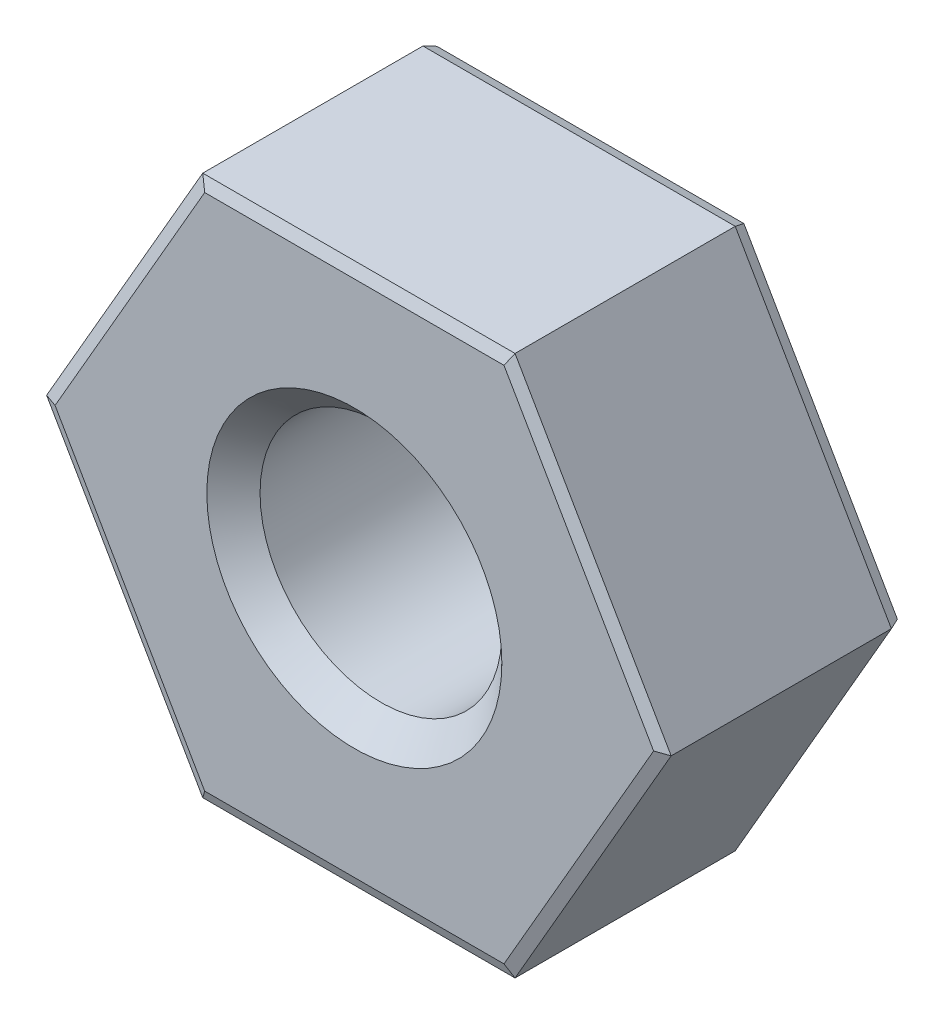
ISO-10303-21;
HEADER;
FILE_DESCRIPTION(('STEP AP214'),'2;1');
FILE_NAME('part.step','',(''),(''),'','','');
FILE_SCHEMA(('AUTOMOTIVE_DESIGN { 1 0 10303 214 1 1 1 1 }'));
ENDSEC;
DATA;
#1=APPLICATION_CONTEXT('core data for automotive mechanical design processes');
#2=APPLICATION_PROTOCOL_DEFINITION('international standard','automotive_design',2000,#1);
#3=PRODUCT_CONTEXT('',#1,'mechanical');
#4=PRODUCT('Part','Part','',(#3));
#5=PRODUCT_RELATED_PRODUCT_CATEGORY('part','',(#4));
#6=PRODUCT_DEFINITION_FORMATION('','',#4);
#7=PRODUCT_DEFINITION_CONTEXT('part definition',#1,'design');
#8=PRODUCT_DEFINITION('design','',#6,#7);
#9=PRODUCT_DEFINITION_SHAPE('','',#8);
#10=(LENGTH_UNIT() NAMED_UNIT(*) SI_UNIT(.MILLI.,.METRE.));
#11=(NAMED_UNIT(*) PLANE_ANGLE_UNIT() SI_UNIT($,.RADIAN.));
#12=(NAMED_UNIT(*) SI_UNIT($,.STERADIAN.) SOLID_ANGLE_UNIT());
#13=UNCERTAINTY_MEASURE_WITH_UNIT(LENGTH_MEASURE(1.E-05),#10,'distance_accuracy_value','');
#14=(GEOMETRIC_REPRESENTATION_CONTEXT(3) GLOBAL_UNCERTAINTY_ASSIGNED_CONTEXT((#13)) GLOBAL_UNIT_ASSIGNED_CONTEXT((#10,
#11,#12)) REPRESENTATION_CONTEXT('',''));
#15=CARTESIAN_POINT('',(0.,0.,0.));
#16=DIRECTION('',(0.,0.,1.));
#17=DIRECTION('',(1.,0.,0.));
#18=AXIS2_PLACEMENT_3D('',#15,#16,#17);
#19=CARTESIAN_POINT('',(1.5877125,2.7499987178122,2.4));
#20=DIRECTION('',(0.866025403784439,0.5,0.));
#21=DIRECTION('',(-0.5,0.866025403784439,0.));
#22=AXIS2_PLACEMENT_3D('',#19,#20,#21);
#23=PLANE('',#22);
#24=DIRECTION('',(0.,0.,-1.));
#25=VECTOR('',#24,1.);
#26=CARTESIAN_POINT('',(3.175425,0.,2.4));
#27=LINE('',#26,#25);
#28=CARTESIAN_POINT('',(3.175425,0.,2.35370155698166));
#29=VERTEX_POINT('',#28);
#30=CARTESIAN_POINT('',(3.175425,0.,0.114592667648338));
#31=VERTEX_POINT('',#30);
#32=EDGE_CURVE('E198',#29,#31,#27,.T.);
#33=ORIENTED_EDGE('',*,*,#32,.T.);
#34=DIRECTION('',(-0.5,0.866025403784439,0.));
#35=VECTOR('',#34,1.);
#36=CARTESIAN_POINT('',(1.5877125,2.7499987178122,0.114592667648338));
#37=LINE('',#36,#35);
#38=CARTESIAN_POINT('',(1.5877125,2.7499987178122,0.114592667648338));
#39=VERTEX_POINT('',#38);
#40=EDGE_CURVE('E130',#31,#39,#37,.T.);
#41=ORIENTED_EDGE('',*,*,#40,.T.);
#42=DIRECTION('',(0.,0.,-1.));
#43=VECTOR('',#42,1.);
#44=CARTESIAN_POINT('',(1.5877125,2.7499987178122,2.4));
#45=LINE('',#44,#43);
#46=CARTESIAN_POINT('',(1.5877125,2.7499987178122,2.35370155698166));
#47=VERTEX_POINT('',#46);
#48=EDGE_CURVE('E254',#47,#39,#45,.T.);
#49=ORIENTED_EDGE('',*,*,#48,.F.);
#50=DIRECTION('',(0.5,-0.866025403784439,0.));
#51=VECTOR('',#50,1.);
#52=CARTESIAN_POINT('',(3.175425,0.,2.35370155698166));
#53=LINE('',#52,#51);
#54=EDGE_CURVE('E150',#47,#29,#53,.T.);
#55=ORIENTED_EDGE('',*,*,#54,.T.);
#56=EDGE_LOOP('',(#33,#41,#49,#55));
#57=FACE_BOUND('',#56,.T.);
#58=ADVANCED_FACE('F34',(#57),#23,.T.);
#59=CARTESIAN_POINT('',(-1.5877125,2.7499987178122,2.4));
#60=DIRECTION('',(0.,1.,0.));
#61=DIRECTION('',(0.,0.,1.));
#62=AXIS2_PLACEMENT_3D('',#59,#60,#61);
#63=PLANE('',#62);
#64=ORIENTED_EDGE('',*,*,#48,.T.);
#65=DIRECTION('',(-1.,0.,0.));
#66=VECTOR('',#65,1.);
#67=CARTESIAN_POINT('',(-1.5877125,2.7499987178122,0.114592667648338));
#68=LINE('',#67,#66);
#69=CARTESIAN_POINT('',(-1.5877125,2.7499987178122,0.114592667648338));
#70=VERTEX_POINT('',#69);
#71=EDGE_CURVE('E160',#39,#70,#68,.T.);
#72=ORIENTED_EDGE('',*,*,#71,.T.);
#73=DIRECTION('',(0.,0.,-1.));
#74=VECTOR('',#73,1.);
#75=CARTESIAN_POINT('',(-1.5877125,2.7499987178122,2.4));
#76=LINE('',#75,#74);
#77=CARTESIAN_POINT('',(-1.5877125,2.7499987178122,2.35370155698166));
#78=VERTEX_POINT('',#77);
#79=EDGE_CURVE('E281',#78,#70,#76,.T.);
#80=ORIENTED_EDGE('',*,*,#79,.F.);
#81=DIRECTION('',(1.,0.,0.));
#82=VECTOR('',#81,1.);
#83=CARTESIAN_POINT('',(1.5877125,2.7499987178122,2.35370155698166));
#84=LINE('',#83,#82);
#85=EDGE_CURVE('E158',#78,#47,#84,.T.);
#86=ORIENTED_EDGE('',*,*,#85,.T.);
#87=EDGE_LOOP('',(#64,#72,#80,#86));
#88=FACE_BOUND('',#87,.T.);
#89=ADVANCED_FACE('F280',(#88),#63,.T.);
#90=CARTESIAN_POINT('',(-3.175425,0.,2.4));
#91=DIRECTION('',(-0.866025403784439,0.5,0.));
#92=DIRECTION('',(-0.5,-0.866025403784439,0.));
#93=AXIS2_PLACEMENT_3D('',#90,#91,#92);
#94=PLANE('',#93);
#95=ORIENTED_EDGE('',*,*,#79,.T.);
#96=DIRECTION('',(-0.5,-0.866025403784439,0.));
#97=VECTOR('',#96,1.);
#98=CARTESIAN_POINT('',(-3.175425,0.,0.114592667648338));
#99=LINE('',#98,#97);
#100=CARTESIAN_POINT('',(-3.175425,0.,0.114592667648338));
#101=VERTEX_POINT('',#100);
#102=EDGE_CURVE('E164',#70,#101,#99,.T.);
#103=ORIENTED_EDGE('',*,*,#102,.T.);
#104=DIRECTION('',(0.,0.,-1.));
#105=VECTOR('',#104,1.);
#106=CARTESIAN_POINT('',(-3.175425,0.,2.4));
#107=LINE('',#106,#105);
#108=CARTESIAN_POINT('',(-3.175425,0.,2.35370155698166));
#109=VERTEX_POINT('',#108);
#110=EDGE_CURVE('E245',#109,#101,#107,.T.);
#111=ORIENTED_EDGE('',*,*,#110,.F.);
#112=DIRECTION('',(0.5,0.866025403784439,0.));
#113=VECTOR('',#112,1.);
#114=CARTESIAN_POINT('',(-1.5877125,2.7499987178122,2.35370155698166));
#115=LINE('',#114,#113);
#116=EDGE_CURVE('E162',#109,#78,#115,.T.);
#117=ORIENTED_EDGE('',*,*,#116,.T.);
#118=EDGE_LOOP('',(#95,#103,#111,#117));
#119=FACE_BOUND('',#118,.T.);
#120=ADVANCED_FACE('F309',(#119),#94,.T.);
#121=CARTESIAN_POINT('',(-1.5877125,-2.7499987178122,2.4));
#122=DIRECTION('',(-0.866025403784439,-0.5,0.));
#123=DIRECTION('',(0.5,-0.866025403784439,0.));
#124=AXIS2_PLACEMENT_3D('',#121,#122,#123);
#125=PLANE('',#124);
#126=ORIENTED_EDGE('',*,*,#110,.T.);
#127=DIRECTION('',(0.5,-0.866025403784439,0.));
#128=VECTOR('',#127,1.);
#129=CARTESIAN_POINT('',(-1.5877125,-2.7499987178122,0.114592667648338));
#130=LINE('',#129,#128);
#131=CARTESIAN_POINT('',(-1.5877125,-2.7499987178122,0.114592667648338));
#132=VERTEX_POINT('',#131);
#133=EDGE_CURVE('E168',#101,#132,#130,.T.);
#134=ORIENTED_EDGE('',*,*,#133,.T.);
#135=DIRECTION('',(0.,0.,-1.));
#136=VECTOR('',#135,1.);
#137=CARTESIAN_POINT('',(-1.5877125,-2.7499987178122,2.4));
#138=LINE('',#137,#136);
#139=CARTESIAN_POINT('',(-1.5877125,-2.7499987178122,2.35370155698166));
#140=VERTEX_POINT('',#139);
#141=EDGE_CURVE('E243',#140,#132,#138,.T.);
#142=ORIENTED_EDGE('',*,*,#141,.F.);
#143=DIRECTION('',(-0.5,0.866025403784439,0.));
#144=VECTOR('',#143,1.);
#145=CARTESIAN_POINT('',(-3.175425,0.,2.35370155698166));
#146=LINE('',#145,#144);
#147=EDGE_CURVE('E166',#140,#109,#146,.T.);
#148=ORIENTED_EDGE('',*,*,#147,.T.);
#149=EDGE_LOOP('',(#126,#134,#142,#148));
#150=FACE_BOUND('',#149,.T.);
#151=ADVANCED_FACE('F288',(#150),#125,.T.);
#152=CARTESIAN_POINT('',(1.5877125,-2.7499987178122,2.4));
#153=DIRECTION('',(0.,-1.,0.));
#154=DIRECTION('',(1.,0.,0.));
#155=AXIS2_PLACEMENT_3D('',#152,#153,#154);
#156=PLANE('',#155);
#157=ORIENTED_EDGE('',*,*,#141,.T.);
#158=DIRECTION('',(1.,0.,0.));
#159=VECTOR('',#158,1.);
#160=CARTESIAN_POINT('',(1.5877125,-2.7499987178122,0.114592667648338));
#161=LINE('',#160,#159);
#162=CARTESIAN_POINT('',(1.5877125,-2.7499987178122,0.114592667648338));
#163=VERTEX_POINT('',#162);
#164=EDGE_CURVE('E173',#132,#163,#161,.T.);
#165=ORIENTED_EDGE('',*,*,#164,.T.);
#166=DIRECTION('',(0.,0.,-1.));
#167=VECTOR('',#166,1.);
#168=CARTESIAN_POINT('',(1.5877125,-2.7499987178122,2.4));
#169=LINE('',#168,#167);
#170=CARTESIAN_POINT('',(1.5877125,-2.7499987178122,2.35370155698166));
#171=VERTEX_POINT('',#170);
#172=EDGE_CURVE('E236',#171,#163,#169,.T.);
#173=ORIENTED_EDGE('',*,*,#172,.F.);
#174=DIRECTION('',(-1.,0.,0.));
#175=VECTOR('',#174,1.);
#176=CARTESIAN_POINT('',(-1.5877125,-2.7499987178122,2.35370155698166));
#177=LINE('',#176,#175);
#178=EDGE_CURVE('E170',#171,#140,#177,.T.);
#179=ORIENTED_EDGE('',*,*,#178,.T.);
#180=EDGE_LOOP('',(#157,#165,#173,#179));
#181=FACE_BOUND('',#180,.T.);
#182=ADVANCED_FACE('F240',(#181),#156,.T.);
#183=CARTESIAN_POINT('',(3.175425,0.,2.4));
#184=DIRECTION('',(0.866025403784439,-0.5,0.));
#185=DIRECTION('',(0.5,0.866025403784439,0.));
#186=AXIS2_PLACEMENT_3D('',#183,#184,#185);
#187=PLANE('',#186);
#188=ORIENTED_EDGE('',*,*,#172,.T.);
#189=DIRECTION('',(0.5,0.866025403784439,0.));
#190=VECTOR('',#189,1.);
#191=CARTESIAN_POINT('',(3.175425,0.,0.114592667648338));
#192=LINE('',#191,#190);
#193=EDGE_CURVE('E177',#163,#31,#192,.T.);
#194=ORIENTED_EDGE('',*,*,#193,.T.);
#195=ORIENTED_EDGE('',*,*,#32,.F.);
#196=DIRECTION('',(-0.5,-0.866025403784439,0.));
#197=VECTOR('',#196,1.);
#198=CARTESIAN_POINT('',(1.5877125,-2.7499987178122,2.35370155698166));
#199=LINE('',#198,#197);
#200=EDGE_CURVE('E175',#29,#171,#199,.T.);
#201=ORIENTED_EDGE('',*,*,#200,.T.);
#202=EDGE_LOOP('',(#188,#194,#195,#201));
#203=FACE_BOUND('',#202,.T.);
#204=ADVANCED_FACE('F235',(#203),#187,.T.);
#205=CARTESIAN_POINT('',(0.,0.,2.4));
#206=DIRECTION('',(0.,0.,-1.));
#207=DIRECTION('',(-1.,0.,0.));
#208=AXIS2_PLACEMENT_3D('',#205,#206,#207);
#209=PLANE('',#208);
#210=DIRECTION('',(0.5,-0.866025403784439,0.));
#211=VECTOR('',#210,1.);
#212=CARTESIAN_POINT('',(-1.48847233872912,-2.69270238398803,2.4));
#213=LINE('',#212,#211);
#214=CARTESIAN_POINT('',(-3.04310478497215,0.,2.4));
#215=VERTEX_POINT('',#214);
#216=CARTESIAN_POINT('',(-1.52155239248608,-2.63540605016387,2.4));
#217=VERTEX_POINT('',#216);
#218=EDGE_CURVE('E43',#215,#217,#213,.T.);
#219=ORIENTED_EDGE('',*,*,#218,.T.);
#220=DIRECTION('',(1.,0.,0.));
#221=VECTOR('',#220,1.);
#222=CARTESIAN_POINT('',(1.5877125,-2.63540605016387,2.4));
#223=LINE('',#222,#221);
#224=CARTESIAN_POINT('',(1.52155239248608,-2.63540605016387,2.4));
#225=VERTEX_POINT('',#224);
#226=EDGE_CURVE('E11',#217,#225,#223,.T.);
#227=ORIENTED_EDGE('',*,*,#226,.T.);
#228=DIRECTION('',(0.5,0.866025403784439,0.));
#229=VECTOR('',#228,1.);
#230=CARTESIAN_POINT('',(3.07618483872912,0.0572963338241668,2.4));
#231=LINE('',#230,#229);
#232=CARTESIAN_POINT('',(3.04310478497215,0.,2.4));
#233=VERTEX_POINT('',#232);
#234=EDGE_CURVE('E179',#225,#233,#231,.T.);
#235=ORIENTED_EDGE('',*,*,#234,.T.);
#236=DIRECTION('',(-0.5,0.866025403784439,0.));
#237=VECTOR('',#236,1.);
#238=CARTESIAN_POINT('',(1.48847233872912,2.69270238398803,2.4));
#239=LINE('',#238,#237);
#240=CARTESIAN_POINT('',(1.52155239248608,2.63540605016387,2.4));
#241=VERTEX_POINT('',#240);
#242=EDGE_CURVE('E181',#233,#241,#239,.T.);
#243=ORIENTED_EDGE('',*,*,#242,.T.);
#244=DIRECTION('',(-1.,0.,0.));
#245=VECTOR('',#244,1.);
#246=CARTESIAN_POINT('',(-1.5877125,2.63540605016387,2.4));
#247=LINE('',#246,#245);
#248=CARTESIAN_POINT('',(-1.52155239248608,2.63540605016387,2.4));
#249=VERTEX_POINT('',#248);
#250=EDGE_CURVE('E183',#241,#249,#247,.T.);
#251=ORIENTED_EDGE('',*,*,#250,.T.);
#252=DIRECTION('',(-0.5,-0.866025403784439,0.));
#253=VECTOR('',#252,1.);
#254=CARTESIAN_POINT('',(-3.07618483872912,-0.0572963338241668,2.4));
#255=LINE('',#254,#253);
#256=EDGE_CURVE('E54',#249,#215,#255,.T.);
#257=ORIENTED_EDGE('',*,*,#256,.T.);
#258=EDGE_LOOP('',(#219,#227,#235,#243,#251,#257));
#259=FACE_BOUND('',#258,.T.);
#260=CARTESIAN_POINT('',(0.,0.,2.4));
#261=DIRECTION('',(0.,0.,-1.));
#262=DIRECTION('',(-1.,0.,0.));
#263=AXIS2_PLACEMENT_3D('',#260,#261,#262);
#264=CIRCLE('',#263,1.49999999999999);
#265=CARTESIAN_POINT('',(-1.49999999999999,0.,2.4));
#266=VERTEX_POINT('',#265);
#267=EDGE_CURVE('E143',#266,#266,#264,.T.);
#268=ORIENTED_EDGE('',*,*,#267,.T.);
#269=EDGE_LOOP('',(#268));
#270=FACE_BOUND('',#269,.T.);
#271=ADVANCED_FACE('F223',(#259,#270),#209,.F.);
#272=CARTESIAN_POINT('',(0.,0.,0.));
#273=DIRECTION('',(0.,0.,-1.));
#274=DIRECTION('',(-1.,0.,0.));
#275=AXIS2_PLACEMENT_3D('',#272,#273,#274);
#276=PLANE('',#275);
#277=DIRECTION('',(1.,0.,0.));
#278=VECTOR('',#277,1.);
#279=CARTESIAN_POINT('',(0.,2.70370027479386,0.));
#280=LINE('',#279,#278);
#281=CARTESIAN_POINT('',(-1.5609820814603,2.70370027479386,0.));
#282=VERTEX_POINT('',#281);
#283=CARTESIAN_POINT('',(1.5609820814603,2.70370027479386,0.));
#284=VERTEX_POINT('',#283);
#285=EDGE_CURVE('E148',#282,#284,#280,.T.);
#286=ORIENTED_EDGE('',*,*,#285,.T.);
#287=DIRECTION('',(0.5,-0.866025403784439,0.));
#288=VECTOR('',#287,1.);
#289=CARTESIAN_POINT('',(2.34147312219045,1.35185013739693,0.));
#290=LINE('',#289,#288);
#291=CARTESIAN_POINT('',(3.1219641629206,0.,0.));
#292=VERTEX_POINT('',#291);
#293=EDGE_CURVE('E128',#284,#292,#290,.T.);
#294=ORIENTED_EDGE('',*,*,#293,.T.);
#295=DIRECTION('',(-0.5,-0.866025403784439,0.));
#296=VECTOR('',#295,1.);
#297=CARTESIAN_POINT('',(2.34147312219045,-1.35185013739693,0.));
#298=LINE('',#297,#296);
#299=CARTESIAN_POINT('',(1.5609820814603,-2.70370027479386,0.));
#300=VERTEX_POINT('',#299);
#301=EDGE_CURVE('E136',#292,#300,#298,.T.);
#302=ORIENTED_EDGE('',*,*,#301,.T.);
#303=DIRECTION('',(-1.,0.,0.));
#304=VECTOR('',#303,1.);
#305=CARTESIAN_POINT('',(0.,-2.70370027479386,0.));
#306=LINE('',#305,#304);
#307=CARTESIAN_POINT('',(-1.5609820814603,-2.70370027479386,0.));
#308=VERTEX_POINT('',#307);
#309=EDGE_CURVE('E142',#300,#308,#306,.T.);
#310=ORIENTED_EDGE('',*,*,#309,.T.);
#311=DIRECTION('',(-0.5,0.866025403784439,0.));
#312=VECTOR('',#311,1.);
#313=CARTESIAN_POINT('',(-2.34147312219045,-1.35185013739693,0.));
#314=LINE('',#313,#312);
#315=CARTESIAN_POINT('',(-3.1219641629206,0.,0.));
#316=VERTEX_POINT('',#315);
#317=EDGE_CURVE('E263',#308,#316,#314,.T.);
#318=ORIENTED_EDGE('',*,*,#317,.T.);
#319=DIRECTION('',(0.5,0.866025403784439,0.));
#320=VECTOR('',#319,1.);
#321=CARTESIAN_POINT('',(-2.34147312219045,1.35185013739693,0.));
#322=LINE('',#321,#320);
#323=EDGE_CURVE('E153',#316,#282,#322,.T.);
#324=ORIENTED_EDGE('',*,*,#323,.T.);
#325=EDGE_LOOP('',(#286,#294,#302,#310,#318,#324));
#326=FACE_BOUND('',#325,.T.);
#327=CARTESIAN_POINT('',(0.,0.,0.));
#328=DIRECTION('',(0.,0.,-1.));
#329=DIRECTION('',(-1.,0.,0.));
#330=AXIS2_PLACEMENT_3D('',#327,#328,#329);
#331=CIRCLE('',#330,1.49999999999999);
#332=CARTESIAN_POINT('',(-1.49999999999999,0.,0.));
#333=VERTEX_POINT('',#332);
#334=EDGE_CURVE('E250',#333,#333,#331,.F.);
#335=ORIENTED_EDGE('',*,*,#334,.T.);
#336=EDGE_LOOP('',(#335));
#337=FACE_BOUND('',#336,.T.);
#338=ADVANCED_FACE('F145',(#326,#337),#276,.T.);
#339=CARTESIAN_POINT('',(0.,0.,2.4));
#340=DIRECTION('',(0.,0.,1.));
#341=DIRECTION('',(1.,0.,0.));
#342=AXIS2_PLACEMENT_3D('',#339,#340,#341);
#343=CYLINDRICAL_SURFACE('',#342,1.22937499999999);
#344=CARTESIAN_POINT('',(0.,0.,0.270625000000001));
#345=DIRECTION('',(0.,0.,-1.));
#346=DIRECTION('',(-1.,0.,0.));
#347=AXIS2_PLACEMENT_3D('',#344,#345,#346);
#348=CIRCLE('',#347,1.22937499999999);
#349=CARTESIAN_POINT('',(-1.22937499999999,0.,0.270625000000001));
#350=VERTEX_POINT('',#349);
#351=EDGE_CURVE('E257',#350,#350,#348,.T.);
#352=ORIENTED_EDGE('',*,*,#351,.T.);
#353=EDGE_LOOP('',(#352));
#354=FACE_BOUND('',#353,.T.);
#355=CARTESIAN_POINT('',(0.,0.,2.129375));
#356=DIRECTION('',(0.,0.,-1.));
#357=DIRECTION('',(-1.,0.,0.));
#358=AXIS2_PLACEMENT_3D('',#355,#356,#357);
#359=CIRCLE('',#358,1.22937499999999);
#360=CARTESIAN_POINT('',(-1.22937499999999,0.,2.129375));
#361=VERTEX_POINT('',#360);
#362=EDGE_CURVE('E253',#361,#361,#359,.F.);
#363=ORIENTED_EDGE('',*,*,#362,.T.);
#364=EDGE_LOOP('',(#363));
#365=FACE_BOUND('',#364,.T.);
#366=ADVANCED_FACE('F318',(#354,#365),#343,.F.);
#367=CARTESIAN_POINT('',(0.,0.,0.));
#368=DIRECTION('',(0.,0.,-1.));
#369=DIRECTION('',(-1.,0.,0.));
#370=AXIS2_PLACEMENT_3D('',#367,#368,#369);
#371=CONICAL_SURFACE('',#370,1.49999999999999,0.785398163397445);
#372=ORIENTED_EDGE('',*,*,#351,.F.);
#373=EDGE_LOOP('',(#372));
#374=FACE_BOUND('',#373,.T.);
#375=ORIENTED_EDGE('',*,*,#334,.F.);
#376=EDGE_LOOP('',(#375));
#377=FACE_BOUND('',#376,.T.);
#378=ADVANCED_FACE('F314',(#374,#377),#371,.F.);
#379=CARTESIAN_POINT('',(0.,0.,2.129375));
#380=DIRECTION('',(0.,0.,1.));
#381=DIRECTION('',(1.,0.,0.));
#382=AXIS2_PLACEMENT_3D('',#379,#380,#381);
#383=CONICAL_SURFACE('',#382,1.22937499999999,0.785398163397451);
#384=ORIENTED_EDGE('',*,*,#267,.F.);
#385=EDGE_LOOP('',(#384));
#386=FACE_BOUND('',#385,.T.);
#387=ORIENTED_EDGE('',*,*,#362,.F.);
#388=EDGE_LOOP('',(#387));
#389=FACE_BOUND('',#388,.T.);
#390=ADVANCED_FACE('F317',(#386,#389),#383,.F.);
#391=CARTESIAN_POINT('',(-2.34147312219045,-1.35185013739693,0.));
#392=DIRECTION('',(0.802964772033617,0.463591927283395,0.374606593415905));
#393=DIRECTION('',(-0.5,0.866025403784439,0.));
#394=AXIS2_PLACEMENT_3D('',#391,#392,#393);
#395=PLANE('',#394);
#396=DIRECTION('',(0.211391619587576,0.366141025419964,-0.906230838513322));
#397=VECTOR('',#396,1.);
#398=CARTESIAN_POINT('',(-1.49122738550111,-2.58288159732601,-0.299036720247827));
#399=LINE('',#398,#397);
#400=EDGE_CURVE('E192',#132,#308,#399,.T.);
#401=ORIENTED_EDGE('',*,*,#400,.F.);
#402=ORIENTED_EDGE('',*,*,#133,.F.);
#403=DIRECTION('',(0.422783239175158,0.,-0.906230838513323));
#404=VECTOR('',#403,1.);
#405=CARTESIAN_POINT('',(-2.9824547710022,0.,-0.29903672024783));
#406=LINE('',#405,#404);
#407=EDGE_CURVE('E195',#316,#101,#406,.F.);
#408=ORIENTED_EDGE('',*,*,#407,.F.);
#409=ORIENTED_EDGE('',*,*,#317,.F.);
#410=EDGE_LOOP('',(#401,#402,#408,#409));
#411=FACE_BOUND('',#410,.T.);
#412=ADVANCED_FACE('F293',(#411),#395,.F.);
#413=CARTESIAN_POINT('',(-2.34147312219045,1.35185013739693,0.));
#414=DIRECTION('',(0.802964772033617,-0.463591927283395,0.374606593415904));
#415=DIRECTION('',(0.5,0.866025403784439,0.));
#416=AXIS2_PLACEMENT_3D('',#413,#414,#415);
#417=PLANE('',#416);
#418=ORIENTED_EDGE('',*,*,#407,.T.);
#419=ORIENTED_EDGE('',*,*,#102,.F.);
#420=DIRECTION('',(0.211391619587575,-0.366141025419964,-0.906230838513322));
#421=VECTOR('',#420,1.);
#422=CARTESIAN_POINT('',(-1.4912273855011,2.582881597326,-0.29903672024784));
#423=LINE('',#422,#421);
#424=EDGE_CURVE('E189',#282,#70,#423,.F.);
#425=ORIENTED_EDGE('',*,*,#424,.F.);
#426=ORIENTED_EDGE('',*,*,#323,.F.);
#427=EDGE_LOOP('',(#418,#419,#425,#426));
#428=FACE_BOUND('',#427,.T.);
#429=ADVANCED_FACE('F270',(#428),#417,.F.);
#430=CARTESIAN_POINT('',(0.,-2.70370027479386,0.));
#431=DIRECTION('',(0.,0.927183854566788,0.37460659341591));
#432=DIRECTION('',(-1.,0.,0.));
#433=AXIS2_PLACEMENT_3D('',#430,#431,#432);
#434=PLANE('',#433);
#435=ORIENTED_EDGE('',*,*,#400,.T.);
#436=ORIENTED_EDGE('',*,*,#309,.F.);
#437=DIRECTION('',(-0.211391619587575,0.366141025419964,-0.906230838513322));
#438=VECTOR('',#437,1.);
#439=CARTESIAN_POINT('',(1.4912273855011,-2.582881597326,-0.29903672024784));
#440=LINE('',#439,#438);
#441=EDGE_CURVE('E139',#163,#300,#440,.T.);
#442=ORIENTED_EDGE('',*,*,#441,.F.);
#443=ORIENTED_EDGE('',*,*,#164,.F.);
#444=EDGE_LOOP('',(#435,#436,#442,#443));
#445=FACE_BOUND('',#444,.T.);
#446=ADVANCED_FACE('F295',(#445),#434,.F.);
#447=CARTESIAN_POINT('',(0.,2.70370027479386,0.));
#448=DIRECTION('',(0.,-0.927183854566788,0.37460659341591));
#449=DIRECTION('',(1.,0.,0.));
#450=AXIS2_PLACEMENT_3D('',#447,#448,#449);
#451=PLANE('',#450);
#452=ORIENTED_EDGE('',*,*,#424,.T.);
#453=ORIENTED_EDGE('',*,*,#71,.F.);
#454=DIRECTION('',(-0.211391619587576,-0.366141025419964,-0.906230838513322));
#455=VECTOR('',#454,1.);
#456=CARTESIAN_POINT('',(1.49122738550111,2.58288159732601,-0.299036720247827));
#457=LINE('',#456,#455);
#458=EDGE_CURVE('E133',#284,#39,#457,.F.);
#459=ORIENTED_EDGE('',*,*,#458,.F.);
#460=ORIENTED_EDGE('',*,*,#285,.F.);
#461=EDGE_LOOP('',(#452,#453,#459,#460));
#462=FACE_BOUND('',#461,.T.);
#463=ADVANCED_FACE('F273',(#462),#451,.F.);
#464=CARTESIAN_POINT('',(2.34147312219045,-1.35185013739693,0.));
#465=DIRECTION('',(-0.802964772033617,0.463591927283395,0.374606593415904));
#466=DIRECTION('',(-0.5,-0.866025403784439,0.));
#467=AXIS2_PLACEMENT_3D('',#464,#465,#466);
#468=PLANE('',#467);
#469=ORIENTED_EDGE('',*,*,#441,.T.);
#470=ORIENTED_EDGE('',*,*,#301,.F.);
#471=DIRECTION('',(0.422783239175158,0.,0.906230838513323));
#472=VECTOR('',#471,1.);
#473=CARTESIAN_POINT('',(2.9824547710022,0.,-0.299036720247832));
#474=LINE('',#473,#472);
#475=EDGE_CURVE('E124',#31,#292,#474,.F.);
#476=ORIENTED_EDGE('',*,*,#475,.F.);
#477=ORIENTED_EDGE('',*,*,#193,.F.);
#478=EDGE_LOOP('',(#469,#470,#476,#477));
#479=FACE_BOUND('',#478,.T.);
#480=ADVANCED_FACE('F137',(#479),#468,.F.);
#481=CARTESIAN_POINT('',(2.34147312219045,1.35185013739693,0.));
#482=DIRECTION('',(-0.802964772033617,-0.463591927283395,0.374606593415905));
#483=DIRECTION('',(0.5,-0.866025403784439,0.));
#484=AXIS2_PLACEMENT_3D('',#481,#482,#483);
#485=PLANE('',#484);
#486=ORIENTED_EDGE('',*,*,#458,.T.);
#487=ORIENTED_EDGE('',*,*,#40,.F.);
#488=ORIENTED_EDGE('',*,*,#475,.T.);
#489=ORIENTED_EDGE('',*,*,#293,.F.);
#490=EDGE_LOOP('',(#486,#487,#488,#489));
#491=FACE_BOUND('',#490,.T.);
#492=ADVANCED_FACE('F126',(#491),#485,.F.);
#493=CARTESIAN_POINT('',(-1.5877125,2.7499987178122,2.35370155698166));
#494=DIRECTION('',(0.,0.374606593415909,0.927183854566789));
#495=DIRECTION('',(-1.,0.,0.));
#496=AXIS2_PLACEMENT_3D('',#493,#494,#495);
#497=PLANE('',#496);
#498=DIRECTION('',(0.471944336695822,-0.817431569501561,0.330263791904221));
#499=VECTOR('',#498,1.);
#500=CARTESIAN_POINT('',(-1.5877125,2.7499987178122,2.35370155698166));
#501=LINE('',#500,#499);
#502=EDGE_CURVE('E208',#249,#78,#501,.F.);
#503=ORIENTED_EDGE('',*,*,#502,.F.);
#504=ORIENTED_EDGE('',*,*,#250,.F.);
#505=DIRECTION('',(-0.471944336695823,-0.817431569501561,0.330263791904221));
#506=VECTOR('',#505,1.);
#507=CARTESIAN_POINT('',(1.5877125,2.7499987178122,2.35370155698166));
#508=LINE('',#507,#506);
#509=EDGE_CURVE('E38',#47,#241,#508,.T.);
#510=ORIENTED_EDGE('',*,*,#509,.F.);
#511=ORIENTED_EDGE('',*,*,#85,.F.);
#512=EDGE_LOOP('',(#503,#504,#510,#511));
#513=FACE_BOUND('',#512,.T.);
#514=ADVANCED_FACE('F36',(#513),#497,.T.);
#515=CARTESIAN_POINT('',(1.5877125,2.7499987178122,2.35370155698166));
#516=DIRECTION('',(0.324418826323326,0.187303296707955,0.927183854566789));
#517=DIRECTION('',(-0.5,0.866025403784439,0.));
#518=AXIS2_PLACEMENT_3D('',#515,#516,#517);
#519=PLANE('',#518);
#520=ORIENTED_EDGE('',*,*,#509,.T.);
#521=ORIENTED_EDGE('',*,*,#242,.F.);
#522=DIRECTION('',(-0.943888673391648,0.,0.330263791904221));
#523=VECTOR('',#522,1.);
#524=CARTESIAN_POINT('',(3.175425,0.,2.35370155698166));
#525=LINE('',#524,#523);
#526=EDGE_CURVE('E206',#29,#233,#525,.T.);
#527=ORIENTED_EDGE('',*,*,#526,.F.);
#528=ORIENTED_EDGE('',*,*,#54,.F.);
#529=EDGE_LOOP('',(#520,#521,#527,#528));
#530=FACE_BOUND('',#529,.T.);
#531=ADVANCED_FACE('F218',(#530),#519,.T.);
#532=CARTESIAN_POINT('',(-3.175425,0.,2.35370155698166));
#533=DIRECTION('',(-0.324418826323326,0.187303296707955,0.927183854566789));
#534=DIRECTION('',(-0.5,-0.866025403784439,0.));
#535=AXIS2_PLACEMENT_3D('',#532,#533,#534);
#536=PLANE('',#535);
#537=ORIENTED_EDGE('',*,*,#502,.T.);
#538=ORIENTED_EDGE('',*,*,#116,.F.);
#539=DIRECTION('',(0.943888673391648,0.,0.330263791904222));
#540=VECTOR('',#539,1.);
#541=CARTESIAN_POINT('',(-3.175425,0.,2.35370155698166));
#542=LINE('',#541,#540);
#543=EDGE_CURVE('E203',#215,#109,#542,.F.);
#544=ORIENTED_EDGE('',*,*,#543,.F.);
#545=ORIENTED_EDGE('',*,*,#256,.F.);
#546=EDGE_LOOP('',(#537,#538,#544,#545));
#547=FACE_BOUND('',#546,.T.);
#548=ADVANCED_FACE('F345',(#547),#536,.T.);
#549=CARTESIAN_POINT('',(3.175425,0.,2.35370155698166));
#550=DIRECTION('',(0.324418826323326,-0.187303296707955,0.927183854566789));
#551=DIRECTION('',(0.5,0.866025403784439,0.));
#552=AXIS2_PLACEMENT_3D('',#549,#550,#551);
#553=PLANE('',#552);
#554=ORIENTED_EDGE('',*,*,#526,.T.);
#555=ORIENTED_EDGE('',*,*,#234,.F.);
#556=DIRECTION('',(0.471944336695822,-0.817431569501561,-0.330263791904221));
#557=VECTOR('',#556,1.);
#558=CARTESIAN_POINT('',(0.880445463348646,-1.52497627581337,2.84864275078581));
#559=LINE('',#558,#557);
#560=EDGE_CURVE('E201',#171,#225,#559,.F.);
#561=ORIENTED_EDGE('',*,*,#560,.F.);
#562=ORIENTED_EDGE('',*,*,#200,.F.);
#563=EDGE_LOOP('',(#554,#555,#561,#562));
#564=FACE_BOUND('',#563,.T.);
#565=ADVANCED_FACE('F228',(#564),#553,.T.);
#566=CARTESIAN_POINT('',(-1.5877125,-2.7499987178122,2.35370155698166));
#567=DIRECTION('',(-0.324418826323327,-0.187303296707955,0.927183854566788));
#568=DIRECTION('',(0.5,-0.866025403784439,0.));
#569=AXIS2_PLACEMENT_3D('',#566,#567,#568);
#570=PLANE('',#569);
#571=ORIENTED_EDGE('',*,*,#543,.T.);
#572=ORIENTED_EDGE('',*,*,#147,.F.);
#573=DIRECTION('',(0.47194433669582,0.817431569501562,0.330263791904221));
#574=VECTOR('',#573,1.);
#575=CARTESIAN_POINT('',(-1.5877125,-2.7499987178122,2.35370155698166));
#576=LINE('',#575,#574);
#577=EDGE_CURVE('E199',#217,#140,#576,.F.);
#578=ORIENTED_EDGE('',*,*,#577,.F.);
#579=ORIENTED_EDGE('',*,*,#218,.F.);
#580=EDGE_LOOP('',(#571,#572,#578,#579));
#581=FACE_BOUND('',#580,.T.);
#582=ADVANCED_FACE('F357',(#581),#570,.T.);
#583=CARTESIAN_POINT('',(1.5877125,-2.7499987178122,2.35370155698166));
#584=DIRECTION('',(0.,-0.374606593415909,0.927183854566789));
#585=DIRECTION('',(1.,0.,0.));
#586=AXIS2_PLACEMENT_3D('',#583,#584,#585);
#587=PLANE('',#586);
#588=ORIENTED_EDGE('',*,*,#560,.T.);
#589=ORIENTED_EDGE('',*,*,#226,.F.);
#590=ORIENTED_EDGE('',*,*,#577,.T.);
#591=ORIENTED_EDGE('',*,*,#178,.F.);
#592=EDGE_LOOP('',(#588,#589,#590,#591));
#593=FACE_BOUND('',#592,.T.);
#594=ADVANCED_FACE('F364',(#593),#587,.T.);
#595=CLOSED_SHELL('',(#58,#89,#120,#151,#182,#204,#271,#338,#366,#378,#390,#412,#429,#446,#463,
#480,#492,#514,#531,#548,#565,#582,#594));
#596=MANIFOLD_SOLID_BREP('B2',#595);
#597=ADVANCED_BREP_SHAPE_REPRESENTATION('',(#18,#596),#14);
#598=SHAPE_DEFINITION_REPRESENTATION(#9,#597);
ENDSEC;
END-ISO-10303-21;
